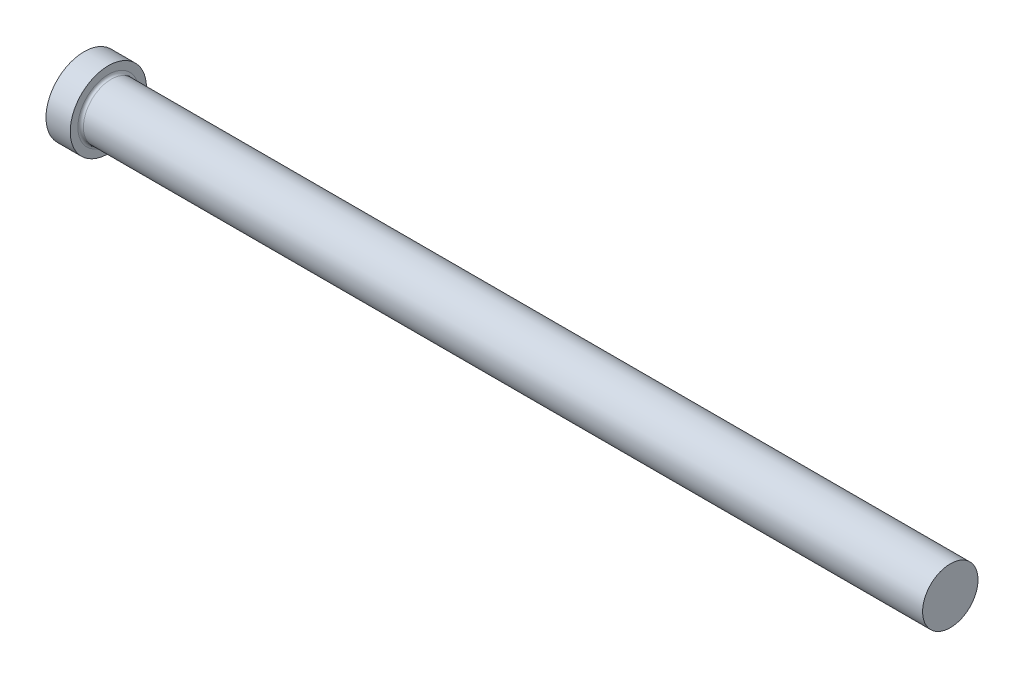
ISO-10303-21;
HEADER;
FILE_DESCRIPTION(('STEP AP214'),'2;1');
FILE_NAME('part.step','',(''),(''),'','','');
FILE_SCHEMA(('AUTOMOTIVE_DESIGN { 1 0 10303 214 1 1 1 1 }'));
ENDSEC;
DATA;
#1=APPLICATION_CONTEXT('core data for automotive mechanical design processes');
#2=APPLICATION_PROTOCOL_DEFINITION('international standard','automotive_design',2000,#1);
#3=PRODUCT_CONTEXT('',#1,'mechanical');
#4=PRODUCT('Part','Part','',(#3));
#5=PRODUCT_RELATED_PRODUCT_CATEGORY('part','',(#4));
#6=PRODUCT_DEFINITION_FORMATION('','',#4);
#7=PRODUCT_DEFINITION_CONTEXT('part definition',#1,'design');
#8=PRODUCT_DEFINITION('design','',#6,#7);
#9=PRODUCT_DEFINITION_SHAPE('','',#8);
#10=(LENGTH_UNIT() NAMED_UNIT(*) SI_UNIT(.MILLI.,.METRE.));
#11=(NAMED_UNIT(*) PLANE_ANGLE_UNIT() SI_UNIT($,.RADIAN.));
#12=(NAMED_UNIT(*) SI_UNIT($,.STERADIAN.) SOLID_ANGLE_UNIT());
#13=UNCERTAINTY_MEASURE_WITH_UNIT(LENGTH_MEASURE(1.E-05),#10,'distance_accuracy_value','');
#14=(GEOMETRIC_REPRESENTATION_CONTEXT(3) GLOBAL_UNCERTAINTY_ASSIGNED_CONTEXT((#13)) GLOBAL_UNIT_ASSIGNED_CONTEXT((#10,
#11,#12)) REPRESENTATION_CONTEXT('',''));
#15=CARTESIAN_POINT('',(0.,0.,0.));
#16=DIRECTION('',(0.,0.,1.));
#17=DIRECTION('',(1.,0.,0.));
#18=AXIS2_PLACEMENT_3D('',#15,#16,#17);
#19=CARTESIAN_POINT('',(0.,0.,0.));
#20=DIRECTION('',(-1.,0.,0.));
#21=DIRECTION('',(0.,-1.,0.));
#22=AXIS2_PLACEMENT_3D('',#19,#20,#21);
#23=PLANE('',#22);
#24=CARTESIAN_POINT('',(0.,0.,0.));
#25=DIRECTION('',(1.,0.,0.));
#26=DIRECTION('',(0.,1.,0.));
#27=AXIS2_PLACEMENT_3D('',#24,#25,#26);
#28=CIRCLE('',#27,11.);
#29=CARTESIAN_POINT('',(0.,11.,0.));
#30=VERTEX_POINT('',#29);
#31=EDGE_CURVE('E25',#30,#30,#28,.T.);
#32=ORIENTED_EDGE('',*,*,#31,.F.);
#33=EDGE_LOOP('',(#32));
#34=FACE_BOUND('',#33,.T.);
#35=ADVANCED_FACE('F14',(#34),#23,.T.);
#36=CARTESIAN_POINT('',(250.,0.,0.));
#37=DIRECTION('',(1.,0.,0.));
#38=DIRECTION('',(0.,1.,0.));
#39=AXIS2_PLACEMENT_3D('',#36,#37,#38);
#40=CYLINDRICAL_SURFACE('',#39,11.);
#41=ORIENTED_EDGE('',*,*,#31,.T.);
#42=EDGE_LOOP('',(#41));
#43=FACE_BOUND('',#42,.T.);
#44=CARTESIAN_POINT('',(7.,0.,0.));
#45=DIRECTION('',(1.,0.,0.));
#46=DIRECTION('',(0.,1.,0.));
#47=AXIS2_PLACEMENT_3D('',#44,#45,#46);
#48=CIRCLE('',#47,11.);
#49=CARTESIAN_POINT('',(7.,11.,0.));
#50=VERTEX_POINT('',#49);
#51=EDGE_CURVE('E29',#50,#50,#48,.T.);
#52=ORIENTED_EDGE('',*,*,#51,.F.);
#53=EDGE_LOOP('',(#52));
#54=FACE_BOUND('',#53,.T.);
#55=ADVANCED_FACE('F51',(#43,#54),#40,.T.);
#56=CARTESIAN_POINT('',(7.,11.,0.));
#57=DIRECTION('',(1.,0.,0.));
#58=DIRECTION('',(0.,1.,0.));
#59=AXIS2_PLACEMENT_3D('',#56,#57,#58);
#60=PLANE('',#59);
#61=CARTESIAN_POINT('',(7.,0.,0.));
#62=DIRECTION('',(1.,0.,0.));
#63=DIRECTION('',(0.,1.,0.));
#64=AXIS2_PLACEMENT_3D('',#61,#62,#63);
#65=CIRCLE('',#64,8.8);
#66=CARTESIAN_POINT('',(7.,8.8,0.));
#67=VERTEX_POINT('',#66);
#68=EDGE_CURVE('E9',#67,#67,#65,.F.);
#69=ORIENTED_EDGE('',*,*,#68,.T.);
#70=EDGE_LOOP('',(#69));
#71=FACE_BOUND('',#70,.T.);
#72=ORIENTED_EDGE('',*,*,#51,.T.);
#73=EDGE_LOOP('',(#72));
#74=FACE_BOUND('',#73,.T.);
#75=ADVANCED_FACE('F42',(#71,#74),#60,.T.);
#76=CARTESIAN_POINT('',(250.,0.,0.));
#77=DIRECTION('',(1.,0.,0.));
#78=DIRECTION('',(0.,1.,0.));
#79=AXIS2_PLACEMENT_3D('',#76,#77,#78);
#80=CYLINDRICAL_SURFACE('',#79,8.);
#81=CARTESIAN_POINT('',(7.8,0.,0.));
#82=DIRECTION('',(1.,0.,0.));
#83=DIRECTION('',(0.,1.,0.));
#84=AXIS2_PLACEMENT_3D('',#81,#82,#83);
#85=CIRCLE('',#84,8.);
#86=CARTESIAN_POINT('',(7.8,8.,0.));
#87=VERTEX_POINT('',#86);
#88=EDGE_CURVE('E21',#87,#87,#85,.T.);
#89=ORIENTED_EDGE('',*,*,#88,.T.);
#90=EDGE_LOOP('',(#89));
#91=FACE_BOUND('',#90,.T.);
#92=CARTESIAN_POINT('',(250.,0.,0.));
#93=DIRECTION('',(1.,0.,0.));
#94=DIRECTION('',(0.,1.,0.));
#95=AXIS2_PLACEMENT_3D('',#92,#93,#94);
#96=CIRCLE('',#95,8.);
#97=CARTESIAN_POINT('',(250.,8.00000000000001,0.));
#98=VERTEX_POINT('',#97);
#99=EDGE_CURVE('E34',#98,#98,#96,.T.);
#100=ORIENTED_EDGE('',*,*,#99,.F.);
#101=EDGE_LOOP('',(#100));
#102=FACE_BOUND('',#101,.T.);
#103=ADVANCED_FACE('F40',(#91,#102),#80,.T.);
#104=CARTESIAN_POINT('',(250.,8.,0.));
#105=DIRECTION('',(1.,0.,0.));
#106=DIRECTION('',(0.,1.,0.));
#107=AXIS2_PLACEMENT_3D('',#104,#105,#106);
#108=PLANE('',#107);
#109=ORIENTED_EDGE('',*,*,#99,.T.);
#110=EDGE_LOOP('',(#109));
#111=FACE_BOUND('',#110,.T.);
#112=ADVANCED_FACE('F38',(#111),#108,.T.);
#113=CARTESIAN_POINT('',(7.8,0.,0.));
#114=DIRECTION('',(1.,0.,0.));
#115=DIRECTION('',(0.,1.,0.));
#116=AXIS2_PLACEMENT_3D('',#113,#114,#115);
#117=TOROIDAL_SURFACE('',#116,8.8,0.8);
#118=ORIENTED_EDGE('',*,*,#68,.F.);
#119=EDGE_LOOP('',(#118));
#120=FACE_BOUND('',#119,.T.);
#121=ORIENTED_EDGE('',*,*,#88,.F.);
#122=EDGE_LOOP('',(#121));
#123=FACE_BOUND('',#122,.T.);
#124=ADVANCED_FACE('F16',(#120,#123),#117,.F.);
#125=CLOSED_SHELL('',(#35,#55,#75,#103,#112,#124));
#126=MANIFOLD_SOLID_BREP('B1',#125);
#127=ADVANCED_BREP_SHAPE_REPRESENTATION('',(#18,#126),#14);
#128=SHAPE_DEFINITION_REPRESENTATION(#9,#127);
ENDSEC;
END-ISO-10303-21;
